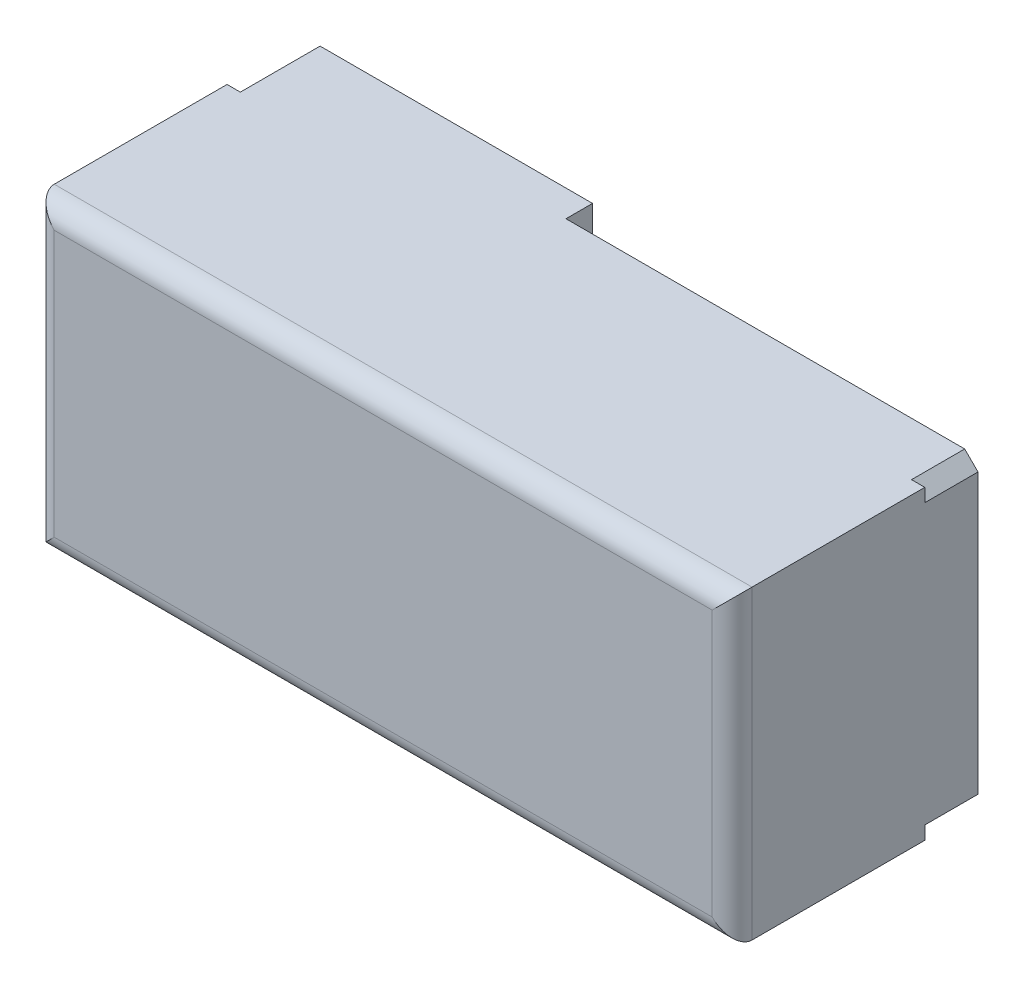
ISO-10303-21;
HEADER;
FILE_DESCRIPTION(('STEP AP214'),'2;1');
FILE_NAME('part.step','',(''),(''),'','','');
FILE_SCHEMA(('AUTOMOTIVE_DESIGN { 1 0 10303 214 1 1 1 1 }'));
ENDSEC;
DATA;
#1=APPLICATION_CONTEXT('core data for automotive mechanical design processes');
#2=APPLICATION_PROTOCOL_DEFINITION('international standard','automotive_design',2000,#1);
#3=PRODUCT_CONTEXT('',#1,'mechanical');
#4=PRODUCT('Part','Part','',(#3));
#5=PRODUCT_RELATED_PRODUCT_CATEGORY('part','',(#4));
#6=PRODUCT_DEFINITION_FORMATION('','',#4);
#7=PRODUCT_DEFINITION_CONTEXT('part definition',#1,'design');
#8=PRODUCT_DEFINITION('design','',#6,#7);
#9=PRODUCT_DEFINITION_SHAPE('','',#8);
#10=(LENGTH_UNIT() NAMED_UNIT(*) SI_UNIT(.MILLI.,.METRE.));
#11=(NAMED_UNIT(*) PLANE_ANGLE_UNIT() SI_UNIT($,.RADIAN.));
#12=(NAMED_UNIT(*) SI_UNIT($,.STERADIAN.) SOLID_ANGLE_UNIT());
#13=UNCERTAINTY_MEASURE_WITH_UNIT(LENGTH_MEASURE(1.E-05),#10,'distance_accuracy_value','');
#14=(GEOMETRIC_REPRESENTATION_CONTEXT(3) GLOBAL_UNCERTAINTY_ASSIGNED_CONTEXT((#13)) GLOBAL_UNIT_ASSIGNED_CONTEXT((#10,
#11,#12)) REPRESENTATION_CONTEXT('',''));
#15=CARTESIAN_POINT('',(0.,0.,0.));
#16=DIRECTION('',(0.,0.,1.));
#17=DIRECTION('',(1.,0.,0.));
#18=AXIS2_PLACEMENT_3D('',#15,#16,#17);
#19=CARTESIAN_POINT('',(52.5,-23.,12.));
#20=DIRECTION('',(-1.,0.,0.));
#21=DIRECTION('',(0.,0.,1.));
#22=AXIS2_PLACEMENT_3D('',#19,#20,#21);
#23=PLANE('',#22);
#24=DIRECTION('',(0.,0.,-1.));
#25=VECTOR('',#24,1.);
#26=CARTESIAN_POINT('',(52.5,23.,41.));
#27=LINE('',#26,#25);
#28=CARTESIAN_POINT('',(52.5,23.,38.));
#29=VERTEX_POINT('',#28);
#30=CARTESIAN_POINT('',(52.5,23.,12.));
#31=VERTEX_POINT('',#30);
#32=EDGE_CURVE('E180',#29,#31,#27,.T.);
#33=ORIENTED_EDGE('',*,*,#32,.F.);
#34=DIRECTION('',(0.,1.,0.));
#35=VECTOR('',#34,1.);
#36=CARTESIAN_POINT('',(52.5,-23.,38.));
#37=LINE('',#36,#35);
#38=CARTESIAN_POINT('',(52.5,-23.,38.));
#39=VERTEX_POINT('',#38);
#40=EDGE_CURVE('E45',#29,#39,#37,.F.);
#41=ORIENTED_EDGE('',*,*,#40,.T.);
#42=DIRECTION('',(0.,0.,-1.));
#43=VECTOR('',#42,1.);
#44=CARTESIAN_POINT('',(52.5,-23.,41.));
#45=LINE('',#44,#43);
#46=CARTESIAN_POINT('',(52.5,-23.,12.));
#47=VERTEX_POINT('',#46);
#48=EDGE_CURVE('E172',#39,#47,#45,.T.);
#49=ORIENTED_EDGE('',*,*,#48,.T.);
#50=DIRECTION('',(0.,1.,0.));
#51=VECTOR('',#50,1.);
#52=CARTESIAN_POINT('',(52.5,23.,12.));
#53=LINE('',#52,#51);
#54=CARTESIAN_POINT('',(52.5,-21.,12.));
#55=VERTEX_POINT('',#54);
#56=EDGE_CURVE('E176',#47,#55,#53,.T.);
#57=ORIENTED_EDGE('',*,*,#56,.T.);
#58=DIRECTION('',(0.,0.,-1.));
#59=VECTOR('',#58,1.);
#60=CARTESIAN_POINT('',(52.5,-21.,12.));
#61=LINE('',#60,#59);
#62=CARTESIAN_POINT('',(52.5,-21.,4.));
#63=VERTEX_POINT('',#62);
#64=EDGE_CURVE('E249',#55,#63,#61,.T.);
#65=ORIENTED_EDGE('',*,*,#64,.T.);
#66=DIRECTION('',(0.,-1.,0.));
#67=VECTOR('',#66,1.);
#68=CARTESIAN_POINT('',(52.5,-23.,4.));
#69=LINE('',#68,#67);
#70=CARTESIAN_POINT('',(52.5,21.,4.));
#71=VERTEX_POINT('',#70);
#72=EDGE_CURVE('E407',#71,#63,#69,.T.);
#73=ORIENTED_EDGE('',*,*,#72,.F.);
#74=DIRECTION('',(0.,0.,1.));
#75=VECTOR('',#74,1.);
#76=CARTESIAN_POINT('',(52.5,21.,12.));
#77=LINE('',#76,#75);
#78=CARTESIAN_POINT('',(52.5,21.,12.));
#79=VERTEX_POINT('',#78);
#80=EDGE_CURVE('E247',#71,#79,#77,.T.);
#81=ORIENTED_EDGE('',*,*,#80,.T.);
#82=EDGE_CURVE('E196',#79,#31,#53,.T.);
#83=ORIENTED_EDGE('',*,*,#82,.T.);
#84=EDGE_LOOP('',(#33,#41,#49,#57,#65,#73,#81,#83));
#85=FACE_BOUND('',#84,.T.);
#86=ADVANCED_FACE('F36',(#85),#23,.F.);
#87=CARTESIAN_POINT('',(22.,0.,-8.));
#88=DIRECTION('',(0.,0.,1.));
#89=DIRECTION('',(1.,0.,0.));
#90=AXIS2_PLACEMENT_3D('',#87,#88,#89);
#91=CYLINDRICAL_SURFACE('',#90,5.);
#92=CARTESIAN_POINT('',(22.,0.,4.));
#93=DIRECTION('',(0.,0.,-1.));
#94=DIRECTION('',(-1.,0.,0.));
#95=AXIS2_PLACEMENT_3D('',#92,#93,#94);
#96=CIRCLE('',#95,5.);
#97=CARTESIAN_POINT('',(22.,5.,4.));
#98=VERTEX_POINT('',#97);
#99=CARTESIAN_POINT('',(22.,-5.,4.));
#100=VERTEX_POINT('',#99);
#101=EDGE_CURVE('E438',#98,#100,#96,.F.);
#102=ORIENTED_EDGE('',*,*,#101,.F.);
#103=DIRECTION('',(0.,0.,1.));
#104=VECTOR('',#103,1.);
#105=CARTESIAN_POINT('',(22.,5.,-8.));
#106=LINE('',#105,#104);
#107=CARTESIAN_POINT('',(22.,5.,12.));
#108=VERTEX_POINT('',#107);
#109=EDGE_CURVE('E311',#98,#108,#106,.T.);
#110=ORIENTED_EDGE('',*,*,#109,.T.);
#111=CARTESIAN_POINT('',(22.,0.,12.));
#112=DIRECTION('',(0.,0.,1.));
#113=DIRECTION('',(1.,0.,0.));
#114=AXIS2_PLACEMENT_3D('',#111,#112,#113);
#115=CIRCLE('',#114,5.);
#116=CARTESIAN_POINT('',(22.,-5.,12.));
#117=VERTEX_POINT('',#116);
#118=EDGE_CURVE('E450',#108,#117,#115,.T.);
#119=ORIENTED_EDGE('',*,*,#118,.T.);
#120=DIRECTION('',(0.,0.,1.));
#121=VECTOR('',#120,1.);
#122=CARTESIAN_POINT('',(22.,-5.,-8.));
#123=LINE('',#122,#121);
#124=EDGE_CURVE('E464',#100,#117,#123,.T.);
#125=ORIENTED_EDGE('',*,*,#124,.F.);
#126=EDGE_LOOP('',(#102,#110,#119,#125));
#127=FACE_BOUND('',#126,.T.);
#128=ADVANCED_FACE('F381',(#127),#91,.F.);
#129=CARTESIAN_POINT('',(22.,5.,-8.));
#130=DIRECTION('',(0.,1.,0.));
#131=DIRECTION('',(0.,0.,1.));
#132=AXIS2_PLACEMENT_3D('',#129,#130,#131);
#133=PLANE('',#132);
#134=DIRECTION('',(-1.,0.,0.));
#135=VECTOR('',#134,1.);
#136=CARTESIAN_POINT('',(22.,5.,4.));
#137=LINE('',#136,#135);
#138=CARTESIAN_POINT('',(32.,5.,4.));
#139=VERTEX_POINT('',#138);
#140=EDGE_CURVE('E436',#139,#98,#137,.T.);
#141=ORIENTED_EDGE('',*,*,#140,.F.);
#142=DIRECTION('',(0.,0.,1.));
#143=VECTOR('',#142,1.);
#144=CARTESIAN_POINT('',(32.,5.,-8.));
#145=LINE('',#144,#143);
#146=CARTESIAN_POINT('',(32.,5.,12.));
#147=VERTEX_POINT('',#146);
#148=EDGE_CURVE('E467',#139,#147,#145,.T.);
#149=ORIENTED_EDGE('',*,*,#148,.T.);
#150=DIRECTION('',(-1.,0.,0.));
#151=VECTOR('',#150,1.);
#152=CARTESIAN_POINT('',(22.,5.,12.));
#153=LINE('',#152,#151);
#154=EDGE_CURVE('E461',#147,#108,#153,.T.);
#155=ORIENTED_EDGE('',*,*,#154,.T.);
#156=ORIENTED_EDGE('',*,*,#109,.F.);
#157=EDGE_LOOP('',(#141,#149,#155,#156));
#158=FACE_BOUND('',#157,.T.);
#159=ADVANCED_FACE('F386',(#158),#133,.F.);
#160=CARTESIAN_POINT('',(32.,0.,-8.));
#161=DIRECTION('',(0.,0.,1.));
#162=DIRECTION('',(1.,0.,0.));
#163=AXIS2_PLACEMENT_3D('',#160,#161,#162);
#164=CYLINDRICAL_SURFACE('',#163,5.);
#165=CARTESIAN_POINT('',(32.,0.,4.));
#166=DIRECTION('',(0.,0.,-1.));
#167=DIRECTION('',(-1.,0.,0.));
#168=AXIS2_PLACEMENT_3D('',#165,#166,#167);
#169=CIRCLE('',#168,5.);
#170=CARTESIAN_POINT('',(32.,-5.,4.));
#171=VERTEX_POINT('',#170);
#172=EDGE_CURVE('E434',#171,#139,#169,.F.);
#173=ORIENTED_EDGE('',*,*,#172,.F.);
#174=DIRECTION('',(0.,0.,1.));
#175=VECTOR('',#174,1.);
#176=CARTESIAN_POINT('',(32.,-5.,-8.));
#177=LINE('',#176,#175);
#178=CARTESIAN_POINT('',(32.,-5.,12.));
#179=VERTEX_POINT('',#178);
#180=EDGE_CURVE('E470',#171,#179,#177,.T.);
#181=ORIENTED_EDGE('',*,*,#180,.T.);
#182=CARTESIAN_POINT('',(32.,0.,12.));
#183=DIRECTION('',(0.,0.,1.));
#184=DIRECTION('',(1.,0.,0.));
#185=AXIS2_PLACEMENT_3D('',#182,#183,#184);
#186=CIRCLE('',#185,5.);
#187=EDGE_CURVE('E458',#179,#147,#186,.T.);
#188=ORIENTED_EDGE('',*,*,#187,.T.);
#189=ORIENTED_EDGE('',*,*,#148,.F.);
#190=EDGE_LOOP('',(#173,#181,#188,#189));
#191=FACE_BOUND('',#190,.T.);
#192=ADVANCED_FACE('F493',(#191),#164,.F.);
#193=CARTESIAN_POINT('',(22.,-5.,-8.));
#194=DIRECTION('',(0.,-1.,0.));
#195=DIRECTION('',(0.,0.,-1.));
#196=AXIS2_PLACEMENT_3D('',#193,#194,#195);
#197=PLANE('',#196);
#198=DIRECTION('',(1.,0.,0.));
#199=VECTOR('',#198,1.);
#200=CARTESIAN_POINT('',(22.,-5.,4.));
#201=LINE('',#200,#199);
#202=EDGE_CURVE('E432',#100,#171,#201,.T.);
#203=ORIENTED_EDGE('',*,*,#202,.F.);
#204=ORIENTED_EDGE('',*,*,#124,.T.);
#205=DIRECTION('',(1.,0.,0.));
#206=VECTOR('',#205,1.);
#207=CARTESIAN_POINT('',(22.,-5.,12.));
#208=LINE('',#207,#206);
#209=EDGE_CURVE('E455',#117,#179,#208,.T.);
#210=ORIENTED_EDGE('',*,*,#209,.T.);
#211=ORIENTED_EDGE('',*,*,#180,.F.);
#212=EDGE_LOOP('',(#203,#204,#210,#211));
#213=FACE_BOUND('',#212,.T.);
#214=ADVANCED_FACE('F401',(#213),#197,.F.);
#215=CARTESIAN_POINT('',(43.5,0.,12.));
#216=DIRECTION('',(0.,0.,1.));
#217=DIRECTION('',(1.,0.,0.));
#218=AXIS2_PLACEMENT_3D('',#215,#216,#217);
#219=CYLINDRICAL_SURFACE('',#218,1.64999999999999);
#220=CARTESIAN_POINT('',(43.5,0.,12.));
#221=DIRECTION('',(0.,0.,1.));
#222=DIRECTION('',(1.,0.,0.));
#223=AXIS2_PLACEMENT_3D('',#220,#221,#222);
#224=CIRCLE('',#223,1.64999999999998);
#225=CARTESIAN_POINT('',(45.15,0.,12.));
#226=VERTEX_POINT('',#225);
#227=EDGE_CURVE('E447',#226,#226,#224,.T.);
#228=ORIENTED_EDGE('',*,*,#227,.T.);
#229=EDGE_LOOP('',(#228));
#230=FACE_BOUND('',#229,.T.);
#231=CARTESIAN_POINT('',(43.5,0.,4.));
#232=DIRECTION('',(0.,0.,-1.));
#233=DIRECTION('',(-1.,0.,0.));
#234=AXIS2_PLACEMENT_3D('',#231,#232,#233);
#235=CIRCLE('',#234,1.64999999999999);
#236=CARTESIAN_POINT('',(41.85,0.,4.));
#237=VERTEX_POINT('',#236);
#238=EDGE_CURVE('E429',#237,#237,#235,.F.);
#239=ORIENTED_EDGE('',*,*,#238,.F.);
#240=EDGE_LOOP('',(#239));
#241=FACE_BOUND('',#240,.T.);
#242=ADVANCED_FACE('F394',(#230,#241),#219,.F.);
#243=CARTESIAN_POINT('',(52.5,-21.,12.));
#244=DIRECTION('',(-0.707106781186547,0.707106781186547,0.));
#245=DIRECTION('',(-0.707106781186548,-0.707106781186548,0.));
#246=AXIS2_PLACEMENT_3D('',#243,#244,#245);
#247=PLANE('',#246);
#248=DIRECTION('',(0.,0.,1.));
#249=VECTOR('',#248,1.);
#250=CARTESIAN_POINT('',(50.5,-23.,12.));
#251=LINE('',#250,#249);
#252=CARTESIAN_POINT('',(50.5,-23.,4.));
#253=VERTEX_POINT('',#252);
#254=CARTESIAN_POINT('',(50.5,-23.,12.));
#255=VERTEX_POINT('',#254);
#256=EDGE_CURVE('E187',#253,#255,#251,.T.);
#257=ORIENTED_EDGE('',*,*,#256,.F.);
#258=DIRECTION('',(-0.707106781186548,-0.707106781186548,0.));
#259=VECTOR('',#258,1.);
#260=CARTESIAN_POINT('',(52.5,-21.,4.));
#261=LINE('',#260,#259);
#262=EDGE_CURVE('E405',#253,#63,#261,.F.);
#263=ORIENTED_EDGE('',*,*,#262,.T.);
#264=ORIENTED_EDGE('',*,*,#64,.F.);
#265=DIRECTION('',(-0.707106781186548,-0.707106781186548,0.));
#266=VECTOR('',#265,1.);
#267=CARTESIAN_POINT('',(52.5,-21.,12.));
#268=LINE('',#267,#266);
#269=EDGE_CURVE('E194',#255,#55,#268,.F.);
#270=ORIENTED_EDGE('',*,*,#269,.F.);
#271=EDGE_LOOP('',(#257,#263,#264,#270));
#272=FACE_BOUND('',#271,.T.);
#273=ADVANCED_FACE('F391',(#272),#247,.F.);
#274=CARTESIAN_POINT('',(50.5,23.,12.));
#275=DIRECTION('',(-0.707106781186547,-0.707106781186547,0.));
#276=DIRECTION('',(0.707106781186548,-0.707106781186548,0.));
#277=AXIS2_PLACEMENT_3D('',#274,#275,#276);
#278=PLANE('',#277);
#279=ORIENTED_EDGE('',*,*,#80,.F.);
#280=DIRECTION('',(0.707106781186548,-0.707106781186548,0.));
#281=VECTOR('',#280,1.);
#282=CARTESIAN_POINT('',(50.5,23.,4.));
#283=LINE('',#282,#281);
#284=CARTESIAN_POINT('',(50.5,23.,4.));
#285=VERTEX_POINT('',#284);
#286=EDGE_CURVE('E265',#71,#285,#283,.F.);
#287=ORIENTED_EDGE('',*,*,#286,.T.);
#288=DIRECTION('',(0.,0.,-1.));
#289=VECTOR('',#288,1.);
#290=CARTESIAN_POINT('',(50.5,23.,12.));
#291=LINE('',#290,#289);
#292=CARTESIAN_POINT('',(50.5,23.,12.));
#293=VERTEX_POINT('',#292);
#294=EDGE_CURVE('E289',#293,#285,#291,.T.);
#295=ORIENTED_EDGE('',*,*,#294,.F.);
#296=DIRECTION('',(0.707106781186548,-0.707106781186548,0.));
#297=VECTOR('',#296,1.);
#298=CARTESIAN_POINT('',(50.5,23.,12.));
#299=LINE('',#298,#297);
#300=EDGE_CURVE('E278',#79,#293,#299,.F.);
#301=ORIENTED_EDGE('',*,*,#300,.F.);
#302=EDGE_LOOP('',(#279,#287,#295,#301));
#303=FACE_BOUND('',#302,.T.);
#304=ADVANCED_FACE('F393',(#303),#278,.F.);
#305=CARTESIAN_POINT('',(-52.5,23.,12.));
#306=DIRECTION('',(0.,-1.,0.));
#307=DIRECTION('',(1.,0.,0.));
#308=AXIS2_PLACEMENT_3D('',#305,#306,#307);
#309=PLANE('',#308);
#310=DIRECTION('',(0.,0.,-1.));
#311=VECTOR('',#310,1.);
#312=CARTESIAN_POINT('',(-52.5,23.,41.));
#313=LINE('',#312,#311);
#314=CARTESIAN_POINT('',(-52.5,23.,38.));
#315=VERTEX_POINT('',#314);
#316=CARTESIAN_POINT('',(-52.5,23.,12.));
#317=VERTEX_POINT('',#316);
#318=EDGE_CURVE('E228',#315,#317,#313,.T.);
#319=ORIENTED_EDGE('',*,*,#318,.F.);
#320=DIRECTION('',(-1.,0.,0.));
#321=VECTOR('',#320,1.);
#322=CARTESIAN_POINT('',(-52.5,23.,38.));
#323=LINE('',#322,#321);
#324=EDGE_CURVE('E60',#315,#29,#323,.F.);
#325=ORIENTED_EDGE('',*,*,#324,.T.);
#326=ORIENTED_EDGE('',*,*,#32,.T.);
#327=DIRECTION('',(-1.,0.,0.));
#328=VECTOR('',#327,1.);
#329=CARTESIAN_POINT('',(52.5,23.,12.));
#330=LINE('',#329,#328);
#331=EDGE_CURVE('E199',#31,#293,#330,.T.);
#332=ORIENTED_EDGE('',*,*,#331,.T.);
#333=ORIENTED_EDGE('',*,*,#294,.T.);
#334=DIRECTION('',(1.,0.,0.));
#335=VECTOR('',#334,1.);
#336=CARTESIAN_POINT('',(-52.5,23.,4.));
#337=LINE('',#336,#335);
#338=CARTESIAN_POINT('',(-9.50000000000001,23.,4.));
#339=VERTEX_POINT('',#338);
#340=EDGE_CURVE('E411',#339,#285,#337,.T.);
#341=ORIENTED_EDGE('',*,*,#340,.F.);
#342=DIRECTION('',(0.,0.,-1.));
#343=VECTOR('',#342,1.);
#344=CARTESIAN_POINT('',(-9.50000000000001,23.,12.));
#345=LINE('',#344,#343);
#346=CARTESIAN_POINT('',(-9.50000000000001,23.,0.));
#347=VERTEX_POINT('',#346);
#348=EDGE_CURVE('E419',#339,#347,#345,.T.);
#349=ORIENTED_EDGE('',*,*,#348,.T.);
#350=DIRECTION('',(-1.,0.,0.));
#351=VECTOR('',#350,1.);
#352=CARTESIAN_POINT('',(-52.5,23.,0.));
#353=LINE('',#352,#351);
#354=CARTESIAN_POINT('',(-50.5,23.,0.));
#355=VERTEX_POINT('',#354);
#356=EDGE_CURVE('E305',#347,#355,#353,.T.);
#357=ORIENTED_EDGE('',*,*,#356,.T.);
#358=DIRECTION('',(0.,0.,1.));
#359=VECTOR('',#358,1.);
#360=CARTESIAN_POINT('',(-50.5,23.,12.));
#361=LINE('',#360,#359);
#362=CARTESIAN_POINT('',(-50.5,23.,12.));
#363=VERTEX_POINT('',#362);
#364=EDGE_CURVE('E269',#355,#363,#361,.T.);
#365=ORIENTED_EDGE('',*,*,#364,.T.);
#366=EDGE_CURVE('E195',#363,#317,#330,.T.);
#367=ORIENTED_EDGE('',*,*,#366,.T.);
#368=EDGE_LOOP('',(#319,#325,#326,#332,#333,#341,#349,#357,#365,#367));
#369=FACE_BOUND('',#368,.T.);
#370=ADVANCED_FACE('F358',(#369),#309,.F.);
#371=CARTESIAN_POINT('',(-52.5,-23.,12.));
#372=DIRECTION('',(1.,0.,0.));
#373=DIRECTION('',(0.,0.,-1.));
#374=AXIS2_PLACEMENT_3D('',#371,#372,#373);
#375=PLANE('',#374);
#376=DIRECTION('',(0.,0.,-1.));
#377=VECTOR('',#376,1.);
#378=CARTESIAN_POINT('',(-52.5,-23.,41.));
#379=LINE('',#378,#377);
#380=CARTESIAN_POINT('',(-52.5,-23.,38.));
#381=VERTEX_POINT('',#380);
#382=CARTESIAN_POINT('',(-52.5,-23.,12.));
#383=VERTEX_POINT('',#382);
#384=EDGE_CURVE('E223',#381,#383,#379,.T.);
#385=ORIENTED_EDGE('',*,*,#384,.F.);
#386=DIRECTION('',(0.,-1.,0.));
#387=VECTOR('',#386,1.);
#388=CARTESIAN_POINT('',(-52.5,-23.,38.));
#389=LINE('',#388,#387);
#390=EDGE_CURVE('E334',#381,#315,#389,.F.);
#391=ORIENTED_EDGE('',*,*,#390,.T.);
#392=ORIENTED_EDGE('',*,*,#318,.T.);
#393=DIRECTION('',(0.,-1.,0.));
#394=VECTOR('',#393,1.);
#395=CARTESIAN_POINT('',(-52.5,-23.,12.));
#396=LINE('',#395,#394);
#397=CARTESIAN_POINT('',(-52.5,21.,12.));
#398=VERTEX_POINT('',#397);
#399=EDGE_CURVE('E221',#317,#398,#396,.T.);
#400=ORIENTED_EDGE('',*,*,#399,.T.);
#401=DIRECTION('',(0.,0.,-1.));
#402=VECTOR('',#401,1.);
#403=CARTESIAN_POINT('',(-52.5,21.,12.));
#404=LINE('',#403,#402);
#405=CARTESIAN_POINT('',(-52.5,21.,0.));
#406=VERTEX_POINT('',#405);
#407=EDGE_CURVE('E270',#398,#406,#404,.T.);
#408=ORIENTED_EDGE('',*,*,#407,.T.);
#409=DIRECTION('',(0.,-1.,0.));
#410=VECTOR('',#409,1.);
#411=CARTESIAN_POINT('',(-52.5,-23.,0.));
#412=LINE('',#411,#410);
#413=CARTESIAN_POINT('',(-52.5,-21.,0.));
#414=VERTEX_POINT('',#413);
#415=EDGE_CURVE('E301',#406,#414,#412,.T.);
#416=ORIENTED_EDGE('',*,*,#415,.T.);
#417=DIRECTION('',(0.,0.,1.));
#418=VECTOR('',#417,1.);
#419=CARTESIAN_POINT('',(-52.5,-21.,12.));
#420=LINE('',#419,#418);
#421=CARTESIAN_POINT('',(-52.5,-21.,12.));
#422=VERTEX_POINT('',#421);
#423=EDGE_CURVE('E240',#414,#422,#420,.T.);
#424=ORIENTED_EDGE('',*,*,#423,.T.);
#425=EDGE_CURVE('E218',#422,#383,#396,.T.);
#426=ORIENTED_EDGE('',*,*,#425,.T.);
#427=EDGE_LOOP('',(#385,#391,#392,#400,#408,#416,#424,#426));
#428=FACE_BOUND('',#427,.T.);
#429=ADVANCED_FACE('F237',(#428),#375,.F.);
#430=CARTESIAN_POINT('',(-52.5,-23.,12.));
#431=DIRECTION('',(0.,1.,0.));
#432=DIRECTION('',(-1.,0.,0.));
#433=AXIS2_PLACEMENT_3D('',#430,#431,#432);
#434=PLANE('',#433);
#435=ORIENTED_EDGE('',*,*,#48,.F.);
#436=DIRECTION('',(1.,0.,0.));
#437=VECTOR('',#436,1.);
#438=CARTESIAN_POINT('',(-52.5,-23.,38.));
#439=LINE('',#438,#437);
#440=EDGE_CURVE('E11',#39,#381,#439,.F.);
#441=ORIENTED_EDGE('',*,*,#440,.T.);
#442=ORIENTED_EDGE('',*,*,#384,.T.);
#443=DIRECTION('',(1.,0.,0.));
#444=VECTOR('',#443,1.);
#445=CARTESIAN_POINT('',(52.5,-23.,12.));
#446=LINE('',#445,#444);
#447=CARTESIAN_POINT('',(-50.5,-23.,12.));
#448=VERTEX_POINT('',#447);
#449=EDGE_CURVE('E191',#383,#448,#446,.T.);
#450=ORIENTED_EDGE('',*,*,#449,.T.);
#451=DIRECTION('',(0.,0.,-1.));
#452=VECTOR('',#451,1.);
#453=CARTESIAN_POINT('',(-50.5,-23.,12.));
#454=LINE('',#453,#452);
#455=CARTESIAN_POINT('',(-50.5,-23.,0.));
#456=VERTEX_POINT('',#455);
#457=EDGE_CURVE('E258',#448,#456,#454,.T.);
#458=ORIENTED_EDGE('',*,*,#457,.T.);
#459=DIRECTION('',(1.,0.,0.));
#460=VECTOR('',#459,1.);
#461=CARTESIAN_POINT('',(-52.5,-23.,0.));
#462=LINE('',#461,#460);
#463=CARTESIAN_POINT('',(-9.50000000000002,-23.,0.));
#464=VERTEX_POINT('',#463);
#465=EDGE_CURVE('E298',#456,#464,#462,.T.);
#466=ORIENTED_EDGE('',*,*,#465,.T.);
#467=DIRECTION('',(0.,0.,1.));
#468=VECTOR('',#467,1.);
#469=CARTESIAN_POINT('',(-9.50000000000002,-23.,12.));
#470=LINE('',#469,#468);
#471=CARTESIAN_POINT('',(-9.50000000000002,-23.,4.));
#472=VERTEX_POINT('',#471);
#473=EDGE_CURVE('E440',#464,#472,#470,.T.);
#474=ORIENTED_EDGE('',*,*,#473,.T.);
#475=DIRECTION('',(-1.,0.,0.));
#476=VECTOR('',#475,1.);
#477=CARTESIAN_POINT('',(-52.5,-23.,4.));
#478=LINE('',#477,#476);
#479=EDGE_CURVE('E427',#253,#472,#478,.T.);
#480=ORIENTED_EDGE('',*,*,#479,.F.);
#481=ORIENTED_EDGE('',*,*,#256,.T.);
#482=EDGE_CURVE('E183',#255,#47,#446,.T.);
#483=ORIENTED_EDGE('',*,*,#482,.T.);
#484=EDGE_LOOP('',(#435,#441,#442,#450,#458,#466,#474,#480,#481,#483));
#485=FACE_BOUND('',#484,.T.);
#486=ADVANCED_FACE('F184',(#485),#434,.F.);
#487=CARTESIAN_POINT('',(52.5,23.,0.));
#488=DIRECTION('',(0.,0.,-1.));
#489=DIRECTION('',(-1.,0.,0.));
#490=AXIS2_PLACEMENT_3D('',#487,#488,#489);
#491=PLANE('',#490);
#492=DIRECTION('',(0.,1.,0.));
#493=VECTOR('',#492,1.);
#494=CARTESIAN_POINT('',(-9.50000000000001,37.1626767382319,0.));
#495=LINE('',#494,#493);
#496=EDGE_CURVE('E423',#464,#347,#495,.T.);
#497=ORIENTED_EDGE('',*,*,#496,.F.);
#498=ORIENTED_EDGE('',*,*,#465,.F.);
#499=DIRECTION('',(0.707106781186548,-0.707106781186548,0.));
#500=VECTOR('',#499,1.);
#501=CARTESIAN_POINT('',(-22.,-51.5,0.));
#502=LINE('',#501,#500);
#503=EDGE_CURVE('E273',#456,#414,#502,.F.);
#504=ORIENTED_EDGE('',*,*,#503,.T.);
#505=ORIENTED_EDGE('',*,*,#415,.F.);
#506=DIRECTION('',(-0.707106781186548,-0.707106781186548,0.));
#507=VECTOR('',#506,1.);
#508=CARTESIAN_POINT('',(1.,74.5,0.));
#509=LINE('',#508,#507);
#510=EDGE_CURVE('E299',#406,#355,#509,.F.);
#511=ORIENTED_EDGE('',*,*,#510,.T.);
#512=ORIENTED_EDGE('',*,*,#356,.F.);
#513=EDGE_LOOP('',(#497,#498,#504,#505,#511,#512));
#514=FACE_BOUND('',#513,.T.);
#515=CARTESIAN_POINT('',(-14.5,0.,0.));
#516=DIRECTION('',(0.,0.,1.));
#517=DIRECTION('',(1.,0.,0.));
#518=AXIS2_PLACEMENT_3D('',#515,#516,#517);
#519=CIRCLE('',#518,1.65);
#520=CARTESIAN_POINT('',(-12.85,0.,0.));
#521=VERTEX_POINT('',#520);
#522=EDGE_CURVE('E443',#521,#521,#519,.T.);
#523=ORIENTED_EDGE('',*,*,#522,.T.);
#524=EDGE_LOOP('',(#523));
#525=FACE_BOUND('',#524,.T.);
#526=CARTESIAN_POINT('',(-31.5,0.,0.));
#527=DIRECTION('',(0.,0.,-1.));
#528=DIRECTION('',(-1.,0.,0.));
#529=AXIS2_PLACEMENT_3D('',#526,#527,#528);
#530=CIRCLE('',#529,8.);
#531=CARTESIAN_POINT('',(-39.5,0.,0.));
#532=VERTEX_POINT('',#531);
#533=EDGE_CURVE('E309',#532,#532,#530,.T.);
#534=ORIENTED_EDGE('',*,*,#533,.F.);
#535=EDGE_LOOP('',(#534));
#536=FACE_BOUND('',#535,.T.);
#537=ADVANCED_FACE('F318',(#514,#525,#536),#491,.T.);
#538=CARTESIAN_POINT('',(-31.5,0.,-8.));
#539=DIRECTION('',(0.,0.,1.));
#540=DIRECTION('',(1.,0.,0.));
#541=AXIS2_PLACEMENT_3D('',#538,#539,#540);
#542=CYLINDRICAL_SURFACE('',#541,8.);
#543=ORIENTED_EDGE('',*,*,#533,.T.);
#544=EDGE_LOOP('',(#543));
#545=FACE_BOUND('',#544,.T.);
#546=CARTESIAN_POINT('',(-31.5,0.,12.));
#547=DIRECTION('',(0.,0.,1.));
#548=DIRECTION('',(1.,0.,0.));
#549=AXIS2_PLACEMENT_3D('',#546,#547,#548);
#550=CIRCLE('',#549,8.);
#551=CARTESIAN_POINT('',(-23.5,0.,12.));
#552=VERTEX_POINT('',#551);
#553=EDGE_CURVE('E179',#552,#552,#550,.T.);
#554=ORIENTED_EDGE('',*,*,#553,.T.);
#555=EDGE_LOOP('',(#554));
#556=FACE_BOUND('',#555,.T.);
#557=ADVANCED_FACE('F505',(#545,#556),#542,.F.);
#558=CARTESIAN_POINT('',(-14.5,0.,12.));
#559=DIRECTION('',(0.,0.,1.));
#560=DIRECTION('',(1.,0.,0.));
#561=AXIS2_PLACEMENT_3D('',#558,#559,#560);
#562=CYLINDRICAL_SURFACE('',#561,1.64999999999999);
#563=ORIENTED_EDGE('',*,*,#522,.F.);
#564=EDGE_LOOP('',(#563));
#565=FACE_BOUND('',#564,.T.);
#566=CARTESIAN_POINT('',(-14.5,0.,12.));
#567=DIRECTION('',(0.,0.,1.));
#568=DIRECTION('',(1.,0.,0.));
#569=AXIS2_PLACEMENT_3D('',#566,#567,#568);
#570=CIRCLE('',#569,1.64999999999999);
#571=CARTESIAN_POINT('',(-12.85,0.,12.));
#572=VERTEX_POINT('',#571);
#573=EDGE_CURVE('E444',#572,#572,#570,.T.);
#574=ORIENTED_EDGE('',*,*,#573,.T.);
#575=EDGE_LOOP('',(#574));
#576=FACE_BOUND('',#575,.T.);
#577=ADVANCED_FACE('F376',(#565,#576),#562,.F.);
#578=CARTESIAN_POINT('',(-50.5,-23.,12.));
#579=DIRECTION('',(0.707106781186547,0.707106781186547,0.));
#580=DIRECTION('',(-0.707106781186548,0.707106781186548,0.));
#581=AXIS2_PLACEMENT_3D('',#578,#579,#580);
#582=PLANE('',#581);
#583=DIRECTION('',(-0.707106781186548,0.707106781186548,0.));
#584=VECTOR('',#583,1.);
#585=CARTESIAN_POINT('',(-50.5,-23.,12.));
#586=LINE('',#585,#584);
#587=EDGE_CURVE('E245',#422,#448,#586,.F.);
#588=ORIENTED_EDGE('',*,*,#587,.F.);
#589=ORIENTED_EDGE('',*,*,#423,.F.);
#590=ORIENTED_EDGE('',*,*,#503,.F.);
#591=ORIENTED_EDGE('',*,*,#457,.F.);
#592=EDGE_LOOP('',(#588,#589,#590,#591));
#593=FACE_BOUND('',#592,.T.);
#594=ADVANCED_FACE('F320',(#593),#582,.F.);
#595=CARTESIAN_POINT('',(-52.5,21.,12.));
#596=DIRECTION('',(0.707106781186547,-0.707106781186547,0.));
#597=DIRECTION('',(0.707106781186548,0.707106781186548,0.));
#598=AXIS2_PLACEMENT_3D('',#595,#596,#597);
#599=PLANE('',#598);
#600=DIRECTION('',(0.707106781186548,0.707106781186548,0.));
#601=VECTOR('',#600,1.);
#602=CARTESIAN_POINT('',(-52.5,21.,12.));
#603=LINE('',#602,#601);
#604=EDGE_CURVE('E251',#363,#398,#603,.F.);
#605=ORIENTED_EDGE('',*,*,#604,.F.);
#606=ORIENTED_EDGE('',*,*,#364,.F.);
#607=ORIENTED_EDGE('',*,*,#510,.F.);
#608=ORIENTED_EDGE('',*,*,#407,.F.);
#609=EDGE_LOOP('',(#605,#606,#607,#608));
#610=FACE_BOUND('',#609,.T.);
#611=ADVANCED_FACE('F365',(#610),#599,.F.);
#612=CARTESIAN_POINT('',(-9.50000000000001,37.1626767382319,4.));
#613=DIRECTION('',(-1.,0.,0.));
#614=DIRECTION('',(0.,-1.,0.));
#615=AXIS2_PLACEMENT_3D('',#612,#613,#614);
#616=PLANE('',#615);
#617=DIRECTION('',(0.,1.,0.));
#618=VECTOR('',#617,1.);
#619=CARTESIAN_POINT('',(-9.50000000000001,37.1626767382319,4.));
#620=LINE('',#619,#618);
#621=EDGE_CURVE('E421',#472,#339,#620,.T.);
#622=ORIENTED_EDGE('',*,*,#621,.F.);
#623=ORIENTED_EDGE('',*,*,#473,.F.);
#624=ORIENTED_EDGE('',*,*,#496,.T.);
#625=ORIENTED_EDGE('',*,*,#348,.F.);
#626=EDGE_LOOP('',(#622,#623,#624,#625));
#627=FACE_BOUND('',#626,.T.);
#628=ADVANCED_FACE('F367',(#627),#616,.F.);
#629=CARTESIAN_POINT('',(75.4224935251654,-32.4777737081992,4.));
#630=DIRECTION('',(0.,0.,-1.));
#631=DIRECTION('',(-1.,0.,0.));
#632=AXIS2_PLACEMENT_3D('',#629,#630,#631);
#633=PLANE('',#632);
#634=ORIENTED_EDGE('',*,*,#238,.T.);
#635=EDGE_LOOP('',(#634));
#636=FACE_BOUND('',#635,.T.);
#637=ORIENTED_EDGE('',*,*,#479,.T.);
#638=ORIENTED_EDGE('',*,*,#621,.T.);
#639=ORIENTED_EDGE('',*,*,#340,.T.);
#640=ORIENTED_EDGE('',*,*,#286,.F.);
#641=ORIENTED_EDGE('',*,*,#72,.T.);
#642=ORIENTED_EDGE('',*,*,#262,.F.);
#643=EDGE_LOOP('',(#637,#638,#639,#640,#641,#642));
#644=FACE_BOUND('',#643,.T.);
#645=ORIENTED_EDGE('',*,*,#101,.T.);
#646=ORIENTED_EDGE('',*,*,#202,.T.);
#647=ORIENTED_EDGE('',*,*,#172,.T.);
#648=ORIENTED_EDGE('',*,*,#140,.T.);
#649=EDGE_LOOP('',(#645,#646,#647,#648));
#650=FACE_BOUND('',#649,.T.);
#651=ADVANCED_FACE('F373',(#636,#644,#650),#633,.T.);
#652=CARTESIAN_POINT('',(0.,0.,12.));
#653=DIRECTION('',(0.,0.,-1.));
#654=DIRECTION('',(-1.,0.,0.));
#655=AXIS2_PLACEMENT_3D('',#652,#653,#654);
#656=PLANE('',#655);
#657=ORIENTED_EDGE('',*,*,#366,.F.);
#658=ORIENTED_EDGE('',*,*,#604,.T.);
#659=ORIENTED_EDGE('',*,*,#399,.F.);
#660=EDGE_LOOP('',(#657,#658,#659));
#661=FACE_BOUND('',#660,.T.);
#662=ADVANCED_FACE('F363',(#661),#656,.T.);
#663=CARTESIAN_POINT('',(0.,0.,41.));
#664=DIRECTION('',(0.,0.,-1.));
#665=DIRECTION('',(-1.,0.,0.));
#666=AXIS2_PLACEMENT_3D('',#663,#664,#665);
#667=PLANE('',#666);
#668=DIRECTION('',(-1.,0.,0.));
#669=VECTOR('',#668,1.);
#670=CARTESIAN_POINT('',(0.,20.,41.));
#671=LINE('',#670,#669);
#672=CARTESIAN_POINT('',(49.5,20.,41.));
#673=VERTEX_POINT('',#672);
#674=CARTESIAN_POINT('',(-49.5,20.,41.));
#675=VERTEX_POINT('',#674);
#676=EDGE_CURVE('E329',#673,#675,#671,.T.);
#677=ORIENTED_EDGE('',*,*,#676,.T.);
#678=DIRECTION('',(0.,-1.,0.));
#679=VECTOR('',#678,1.);
#680=CARTESIAN_POINT('',(-49.5,0.,41.));
#681=LINE('',#680,#679);
#682=CARTESIAN_POINT('',(-49.5,-20.,41.));
#683=VERTEX_POINT('',#682);
#684=EDGE_CURVE('E331',#675,#683,#681,.T.);
#685=ORIENTED_EDGE('',*,*,#684,.T.);
#686=DIRECTION('',(1.,0.,0.));
#687=VECTOR('',#686,1.);
#688=CARTESIAN_POINT('',(0.,-20.,41.));
#689=LINE('',#688,#687);
#690=CARTESIAN_POINT('',(49.5,-20.,41.));
#691=VERTEX_POINT('',#690);
#692=EDGE_CURVE('E268',#683,#691,#689,.T.);
#693=ORIENTED_EDGE('',*,*,#692,.T.);
#694=DIRECTION('',(0.,1.,0.));
#695=VECTOR('',#694,1.);
#696=CARTESIAN_POINT('',(49.5,0.,41.));
#697=LINE('',#696,#695);
#698=EDGE_CURVE('E327',#691,#673,#697,.T.);
#699=ORIENTED_EDGE('',*,*,#698,.T.);
#700=EDGE_LOOP('',(#677,#685,#693,#699));
#701=FACE_BOUND('',#700,.T.);
#702=ADVANCED_FACE('F546',(#701),#667,.F.);
#703=ORIENTED_EDGE('',*,*,#82,.F.);
#704=ORIENTED_EDGE('',*,*,#300,.T.);
#705=ORIENTED_EDGE('',*,*,#331,.F.);
#706=EDGE_LOOP('',(#703,#704,#705));
#707=FACE_BOUND('',#706,.T.);
#708=ADVANCED_FACE('F416',(#707),#656,.T.);
#709=ORIENTED_EDGE('',*,*,#482,.F.);
#710=ORIENTED_EDGE('',*,*,#269,.T.);
#711=ORIENTED_EDGE('',*,*,#56,.F.);
#712=EDGE_LOOP('',(#709,#710,#711));
#713=FACE_BOUND('',#712,.T.);
#714=ADVANCED_FACE('F193',(#713),#656,.T.);
#715=ORIENTED_EDGE('',*,*,#425,.F.);
#716=ORIENTED_EDGE('',*,*,#587,.T.);
#717=ORIENTED_EDGE('',*,*,#449,.F.);
#718=EDGE_LOOP('',(#715,#716,#717));
#719=FACE_BOUND('',#718,.T.);
#720=ADVANCED_FACE('F244',(#719),#656,.T.);
#721=ORIENTED_EDGE('',*,*,#553,.F.);
#722=EDGE_LOOP('',(#721));
#723=FACE_BOUND('',#722,.T.);
#724=ADVANCED_FACE('F573',(#723),#656,.T.);
#725=ORIENTED_EDGE('',*,*,#209,.F.);
#726=ORIENTED_EDGE('',*,*,#118,.F.);
#727=ORIENTED_EDGE('',*,*,#154,.F.);
#728=ORIENTED_EDGE('',*,*,#187,.F.);
#729=EDGE_LOOP('',(#725,#726,#727,#728));
#730=FACE_BOUND('',#729,.T.);
#731=ADVANCED_FACE('F490',(#730),#656,.T.);
#732=ORIENTED_EDGE('',*,*,#227,.F.);
#733=EDGE_LOOP('',(#732));
#734=FACE_BOUND('',#733,.T.);
#735=ADVANCED_FACE('F589',(#734),#656,.T.);
#736=ORIENTED_EDGE('',*,*,#573,.F.);
#737=EDGE_LOOP('',(#736));
#738=FACE_BOUND('',#737,.T.);
#739=ADVANCED_FACE('F548',(#738),#656,.T.);
#740=CARTESIAN_POINT('',(49.5,0.,38.));
#741=DIRECTION('',(0.,1.,0.));
#742=DIRECTION('',(0.,0.,1.));
#743=AXIS2_PLACEMENT_3D('',#740,#741,#742);
#744=CYLINDRICAL_SURFACE('',#743,3.);
#745=CARTESIAN_POINT('',(49.5,-20.,38.));
#746=DIRECTION('',(0.707106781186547,0.707106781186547,0.));
#747=DIRECTION('',(0.707106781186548,-0.707106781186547,0.));
#748=AXIS2_PLACEMENT_3D('',#745,#746,#747);
#749=ELLIPSE('',#748,4.24264068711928,3.);
#750=EDGE_CURVE('E341',#39,#691,#749,.F.);
#751=ORIENTED_EDGE('',*,*,#750,.F.);
#752=ORIENTED_EDGE('',*,*,#40,.F.);
#753=CARTESIAN_POINT('',(49.5,20.,38.));
#754=DIRECTION('',(-0.707106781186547,0.707106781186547,0.));
#755=DIRECTION('',(0.707106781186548,0.707106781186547,0.));
#756=AXIS2_PLACEMENT_3D('',#753,#754,#755);
#757=ELLIPSE('',#756,4.24264068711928,3.);
#758=EDGE_CURVE('E40',#673,#29,#757,.T.);
#759=ORIENTED_EDGE('',*,*,#758,.F.);
#760=ORIENTED_EDGE('',*,*,#698,.F.);
#761=EDGE_LOOP('',(#751,#752,#759,#760));
#762=FACE_BOUND('',#761,.T.);
#763=ADVANCED_FACE('F38',(#762),#744,.T.);
#764=CARTESIAN_POINT('',(0.,20.,38.));
#765=DIRECTION('',(-1.,0.,0.));
#766=DIRECTION('',(0.,-1.,0.));
#767=AXIS2_PLACEMENT_3D('',#764,#765,#766);
#768=CYLINDRICAL_SURFACE('',#767,3.);
#769=ORIENTED_EDGE('',*,*,#758,.T.);
#770=ORIENTED_EDGE('',*,*,#324,.F.);
#771=CARTESIAN_POINT('',(-49.5,20.,38.));
#772=DIRECTION('',(-0.707106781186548,-0.707106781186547,0.));
#773=DIRECTION('',(-0.707106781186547,0.707106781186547,0.));
#774=AXIS2_PLACEMENT_3D('',#771,#772,#773);
#775=ELLIPSE('',#774,4.24264068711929,3.);
#776=EDGE_CURVE('E340',#675,#315,#775,.T.);
#777=ORIENTED_EDGE('',*,*,#776,.F.);
#778=ORIENTED_EDGE('',*,*,#676,.F.);
#779=EDGE_LOOP('',(#769,#770,#777,#778));
#780=FACE_BOUND('',#779,.T.);
#781=ADVANCED_FACE('F349',(#780),#768,.T.);
#782=CARTESIAN_POINT('',(0.,-20.,38.));
#783=DIRECTION('',(1.,0.,0.));
#784=DIRECTION('',(0.,1.,0.));
#785=AXIS2_PLACEMENT_3D('',#782,#783,#784);
#786=CYLINDRICAL_SURFACE('',#785,3.);
#787=ORIENTED_EDGE('',*,*,#750,.T.);
#788=ORIENTED_EDGE('',*,*,#692,.F.);
#789=CARTESIAN_POINT('',(-49.5,-20.,38.));
#790=DIRECTION('',(0.707106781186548,-0.707106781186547,0.));
#791=DIRECTION('',(0.707106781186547,0.707106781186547,0.));
#792=AXIS2_PLACEMENT_3D('',#789,#790,#791);
#793=ELLIPSE('',#792,4.24264068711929,3.);
#794=EDGE_CURVE('E338',#381,#683,#793,.F.);
#795=ORIENTED_EDGE('',*,*,#794,.F.);
#796=ORIENTED_EDGE('',*,*,#440,.F.);
#797=EDGE_LOOP('',(#787,#788,#795,#796));
#798=FACE_BOUND('',#797,.T.);
#799=ADVANCED_FACE('F354',(#798),#786,.T.);
#800=CARTESIAN_POINT('',(-49.5,0.,38.));
#801=DIRECTION('',(0.,-1.,0.));
#802=DIRECTION('',(0.,0.,-1.));
#803=AXIS2_PLACEMENT_3D('',#800,#801,#802);
#804=CYLINDRICAL_SURFACE('',#803,3.);
#805=ORIENTED_EDGE('',*,*,#776,.T.);
#806=ORIENTED_EDGE('',*,*,#390,.F.);
#807=ORIENTED_EDGE('',*,*,#794,.T.);
#808=ORIENTED_EDGE('',*,*,#684,.F.);
#809=EDGE_LOOP('',(#805,#806,#807,#808));
#810=FACE_BOUND('',#809,.T.);
#811=ADVANCED_FACE('F357',(#810),#804,.T.);
#812=CLOSED_SHELL('',(#86,#128,#159,#192,#214,#242,#273,#304,#370,#429,#486,#537,#557,#577,#594,
#611,#628,#651,#662,#702,#708,#714,#720,#724,#731,#735,#739,#763,#781,#799,#811));
#813=MANIFOLD_SOLID_BREP('B2',#812);
#814=ADVANCED_BREP_SHAPE_REPRESENTATION('',(#18,#813),#14);
#815=SHAPE_DEFINITION_REPRESENTATION(#9,#814);
ENDSEC;
END-ISO-10303-21;
